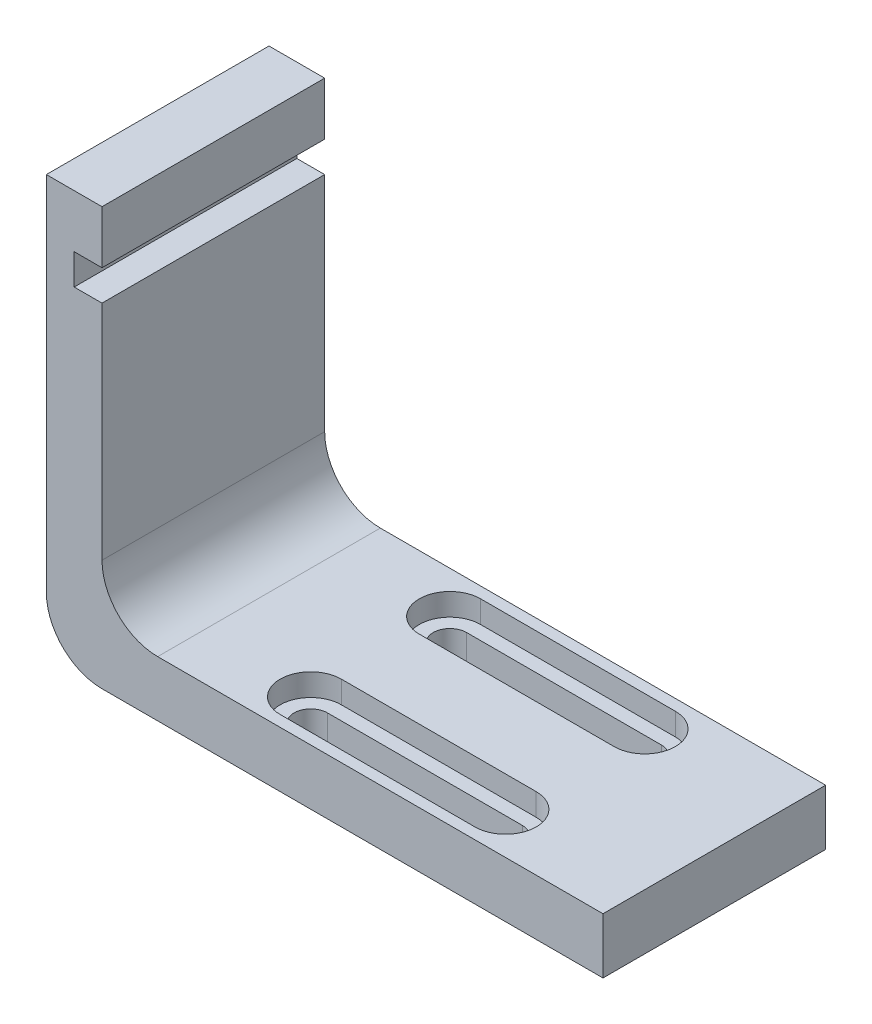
from build123d import *

# Parameters (mm, degrees)
BOSS_EXTRUDE1_DEPTH      = 20
BOSS_EXTRUDE1_DEPTH_BACK = 20
SKETCH2_W                = 5
SKETCH2_H                = 5.5
CUT_EXTRUDE1_DEPTH       = 100
FILLET1_R                = 10
CUT_EXTRUDE4_DEPTH       = 4
CUT_EXTRUDE5_DEPTH       = 6
SKETCH8_R                = 1.5
CUT_EXTRUDE6_DEPTH       = 16


with BuildPart() as part:
    # Sketch1 → Boss-Extrude1 (new, two sides: drawn at the far end of the back side and taken through both)
    with BuildSketch(Plane.XY.offset(-BOSS_EXTRUDE1_DEPTH_BACK)):
        Polygon((0, 0), (100, 0), (100, 10), (10, 10), (10, 75), (0, 75), align=None)
    extrude(amount=BOSS_EXTRUDE1_DEPTH + BOSS_EXTRUDE1_DEPTH_BACK)

    # Sketch2 → Cut-Extrude1 (cut)
    with BuildSketch(Plane.XY.offset(20)):
        with Locations((7.5, 62.75)):
            Rectangle(SKETCH2_W, SKETCH2_H)
    extrude(amount=-CUT_EXTRUDE1_DEPTH, mode=Mode.SUBTRACT)

    # Fillet1
    fillet1_edges = [part.edges().sort_by_distance(p)[0] for p in [
        (10, 10, 0),
        (0, 0, 0),
    ]]
    fillet(fillet1_edges, radius=FILLET1_R)

    # Sketch5 → Cut-Extrude4 (cut)
    with BuildSketch(Plane(origin=(0, 10, 0), x_dir=(1, 0, 0), z_dir=(0, 1, 0))):
        with BuildLine():
            Line((40, -7), (75, -7))
            ThreePointArc((75, -7), (80.5, -12.5), (75, -18))
            Line((75, -18), (40, -18))
            ThreePointArc((40, -18), (34.5, -12.5), (40, -7))
        make_face()
        with BuildLine():
            Line((40, 7), (75, 7))
            ThreePointArc((75, 7), (80.5, 12.5), (75, 18))
            Line((75, 18), (40, 18))
            ThreePointArc((40, 18), (34.5, 12.5), (40, 7))
        make_face()
    extrude(amount=-CUT_EXTRUDE4_DEPTH, mode=Mode.SUBTRACT)

    # Sketch6 → Cut-Extrude5 (cut)
    with BuildSketch(Plane(origin=(0, 6, 0), x_dir=(1, 0, 0), z_dir=(0, 1, 0))):
        with BuildLine():
            Line((75, 9.5), (40, 9.5))
            ThreePointArc((40, 9.5), (37, 12.5), (40, 15.5))
            Line((40, 15.5), (75, 15.5))
            ThreePointArc((75, 15.5), (78, 12.5), (75, 9.5))
        make_face()
        with BuildLine():
            Line((40, -15.5), (75, -15.5))
            ThreePointArc((75, -15.5), (78, -12.5), (75, -9.5))
            Line((75, -9.5), (40, -9.5))
            ThreePointArc((40, -9.5), (37, -12.5), (40, -15.5))
        make_face()
    extrude(amount=-CUT_EXTRUDE5_DEPTH, mode=Mode.SUBTRACT)

    # Sketch8 → Cut-Extrude6 (cut)
    with BuildSketch(Plane(origin=(10, 0, 0), x_dir=(0, 0, -1), z_dir=(1, 0, 0))):
        with Locations(Location((0, 63, 0), (0, 0, 180))):
            Circle(SKETCH8_R)
    extrude(amount=-CUT_EXTRUDE6_DEPTH, mode=Mode.SUBTRACT)


solid = part.part
